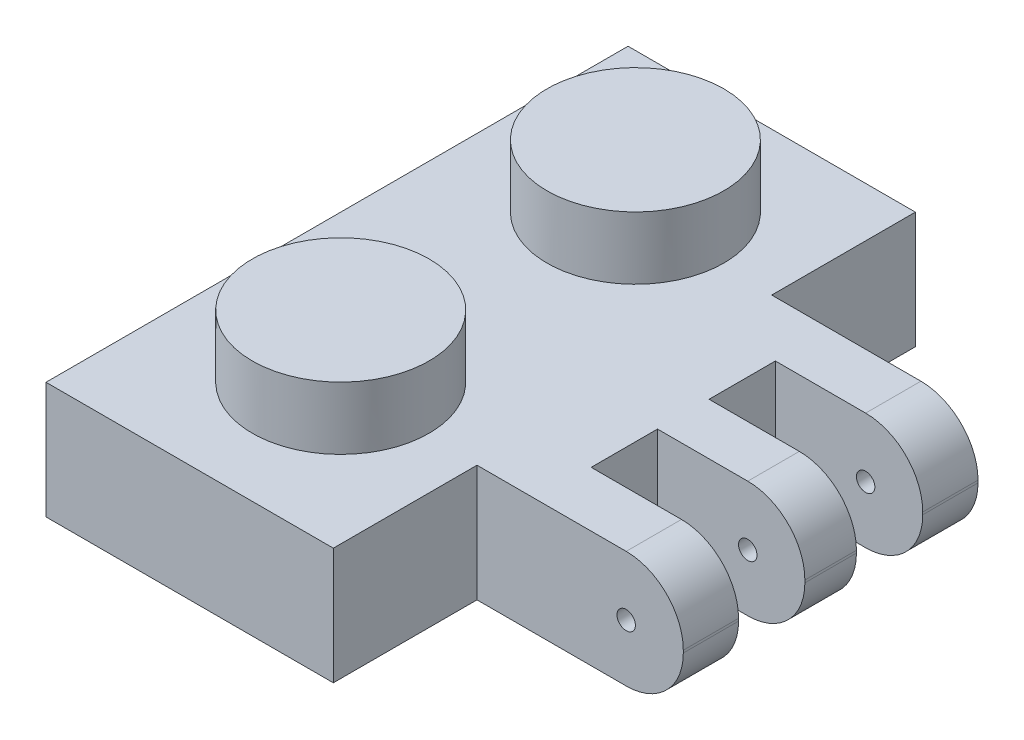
ISO-10303-21;
HEADER;
FILE_DESCRIPTION(('STEP AP214'),'2;1');
FILE_NAME('part.step','',(''),(''),'','','');
FILE_SCHEMA(('AUTOMOTIVE_DESIGN { 1 0 10303 214 1 1 1 1 }'));
ENDSEC;
DATA;
#1=APPLICATION_CONTEXT('core data for automotive mechanical design processes');
#2=APPLICATION_PROTOCOL_DEFINITION('international standard','automotive_design',2000,#1);
#3=PRODUCT_CONTEXT('',#1,'mechanical');
#4=PRODUCT('Part','Part','',(#3));
#5=PRODUCT_RELATED_PRODUCT_CATEGORY('part','',(#4));
#6=PRODUCT_DEFINITION_FORMATION('','',#4);
#7=PRODUCT_DEFINITION_CONTEXT('part definition',#1,'design');
#8=PRODUCT_DEFINITION('design','',#6,#7);
#9=PRODUCT_DEFINITION_SHAPE('','',#8);
#10=(LENGTH_UNIT() NAMED_UNIT(*) SI_UNIT(.MILLI.,.METRE.));
#11=(NAMED_UNIT(*) PLANE_ANGLE_UNIT() SI_UNIT($,.RADIAN.));
#12=(NAMED_UNIT(*) SI_UNIT($,.STERADIAN.) SOLID_ANGLE_UNIT());
#13=UNCERTAINTY_MEASURE_WITH_UNIT(LENGTH_MEASURE(1.E-05),#10,'distance_accuracy_value','');
#14=(GEOMETRIC_REPRESENTATION_CONTEXT(3) GLOBAL_UNCERTAINTY_ASSIGNED_CONTEXT((#13)) GLOBAL_UNIT_ASSIGNED_CONTEXT((#10,
#11,#12)) REPRESENTATION_CONTEXT('',''));
#15=CARTESIAN_POINT('',(0.,0.,0.));
#16=DIRECTION('',(0.,0.,1.));
#17=DIRECTION('',(1.,0.,0.));
#18=AXIS2_PLACEMENT_3D('',#15,#16,#17);
#19=CARTESIAN_POINT('',(13.4,0.,-3.9));
#20=DIRECTION('',(1.,0.,0.));
#21=DIRECTION('',(0.,0.,-1.));
#22=AXIS2_PLACEMENT_3D('',#19,#20,#21);
#23=PLANE('',#22);
#24=DIRECTION('',(0.,-1.,0.));
#25=VECTOR('',#24,1.);
#26=CARTESIAN_POINT('',(13.4,3.166,-3.9));
#27=LINE('',#26,#25);
#28=CARTESIAN_POINT('',(13.4,1.616,-3.9));
#29=VERTEX_POINT('',#28);
#30=CARTESIAN_POINT('',(13.4,1.55,-3.9));
#31=VERTEX_POINT('',#30);
#32=EDGE_CURVE('E302',#29,#31,#27,.T.);
#33=ORIENTED_EDGE('',*,*,#32,.T.);
#34=DIRECTION('',(0.,0.,-1.));
#35=VECTOR('',#34,1.);
#36=CARTESIAN_POINT('',(13.4,1.55,-3.9));
#37=LINE('',#36,#35);
#38=CARTESIAN_POINT('',(13.4,1.55,-5.4));
#39=VERTEX_POINT('',#38);
#40=EDGE_CURVE('E350',#31,#39,#37,.T.);
#41=ORIENTED_EDGE('',*,*,#40,.T.);
#42=DIRECTION('',(0.,1.,0.));
#43=VECTOR('',#42,1.);
#44=CARTESIAN_POINT('',(13.4,-5.00000000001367E-05,-5.4));
#45=LINE('',#44,#43);
#46=CARTESIAN_POINT('',(13.4,1.616,-5.4));
#47=VERTEX_POINT('',#46);
#48=EDGE_CURVE('E267',#39,#47,#45,.T.);
#49=ORIENTED_EDGE('',*,*,#48,.T.);
#50=DIRECTION('',(0.,0.,1.));
#51=VECTOR('',#50,1.);
#52=CARTESIAN_POINT('',(13.4,1.616,-3.9));
#53=LINE('',#52,#51);
#54=EDGE_CURVE('E348',#47,#29,#53,.T.);
#55=ORIENTED_EDGE('',*,*,#54,.T.);
#56=EDGE_LOOP('',(#33,#41,#49,#55));
#57=FACE_BOUND('',#56,.T.);
#58=ADVANCED_FACE('F36',(#57),#23,.T.);
#59=DIRECTION('',(0.,1.,0.));
#60=VECTOR('',#59,1.);
#61=CARTESIAN_POINT('',(13.4,-5.00000000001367E-05,-7.2));
#62=LINE('',#61,#60);
#63=CARTESIAN_POINT('',(13.4,1.55,-7.2));
#64=VERTEX_POINT('',#63);
#65=CARTESIAN_POINT('',(13.4,1.616,-7.2));
#66=VERTEX_POINT('',#65);
#67=EDGE_CURVE('E256',#64,#66,#62,.T.);
#68=ORIENTED_EDGE('',*,*,#67,.F.);
#69=DIRECTION('',(0.,0.,-1.));
#70=VECTOR('',#69,1.);
#71=CARTESIAN_POINT('',(13.4,1.55,-3.9));
#72=LINE('',#71,#70);
#73=CARTESIAN_POINT('',(13.4,1.55,-8.6));
#74=VERTEX_POINT('',#73);
#75=EDGE_CURVE('E338',#64,#74,#72,.T.);
#76=ORIENTED_EDGE('',*,*,#75,.T.);
#77=DIRECTION('',(0.,-1.,0.));
#78=VECTOR('',#77,1.);
#79=CARTESIAN_POINT('',(13.4,3.166,-8.6));
#80=LINE('',#79,#78);
#81=CARTESIAN_POINT('',(13.4,1.616,-8.6));
#82=VERTEX_POINT('',#81);
#83=EDGE_CURVE('E270',#82,#74,#80,.T.);
#84=ORIENTED_EDGE('',*,*,#83,.F.);
#85=DIRECTION('',(0.,0.,1.));
#86=VECTOR('',#85,1.);
#87=CARTESIAN_POINT('',(13.4,1.616,-7.2));
#88=LINE('',#87,#86);
#89=EDGE_CURVE('E335',#82,#66,#88,.T.);
#90=ORIENTED_EDGE('',*,*,#89,.T.);
#91=EDGE_LOOP('',(#68,#76,#84,#90));
#92=FACE_BOUND('',#91,.T.);
#93=ADVANCED_FACE('F577',(#92),#23,.T.);
#94=CARTESIAN_POINT('',(7.8,3.166,0.));
#95=DIRECTION('',(-1.,0.,0.));
#96=DIRECTION('',(0.,0.,1.));
#97=AXIS2_PLACEMENT_3D('',#94,#95,#96);
#98=PLANE('',#97);
#99=DIRECTION('',(0.,-1.,0.));
#100=VECTOR('',#99,1.);
#101=CARTESIAN_POINT('',(7.8,3.166,-3.9));
#102=LINE('',#101,#100);
#103=CARTESIAN_POINT('',(7.8,3.166,-3.9));
#104=VERTEX_POINT('',#103);
#105=CARTESIAN_POINT('',(7.8,0.,-3.9));
#106=VERTEX_POINT('',#105);
#107=EDGE_CURVE('E294',#104,#106,#102,.T.);
#108=ORIENTED_EDGE('',*,*,#107,.F.);
#109=DIRECTION('',(0.,0.,-1.));
#110=VECTOR('',#109,1.);
#111=CARTESIAN_POINT('',(7.8,3.166,0.));
#112=LINE('',#111,#110);
#113=CARTESIAN_POINT('',(7.8,3.166,0.));
#114=VERTEX_POINT('',#113);
#115=EDGE_CURVE('E362',#114,#104,#112,.T.);
#116=ORIENTED_EDGE('',*,*,#115,.F.);
#117=DIRECTION('',(0.,-1.,0.));
#118=VECTOR('',#117,1.);
#119=CARTESIAN_POINT('',(7.8,3.166,0.));
#120=LINE('',#119,#118);
#121=CARTESIAN_POINT('',(7.8,0.,0.));
#122=VERTEX_POINT('',#121);
#123=EDGE_CURVE('E435',#114,#122,#120,.T.);
#124=ORIENTED_EDGE('',*,*,#123,.T.);
#125=DIRECTION('',(0.,0.,-1.));
#126=VECTOR('',#125,1.);
#127=CARTESIAN_POINT('',(7.8,0.,0.));
#128=LINE('',#127,#126);
#129=EDGE_CURVE('E423',#122,#106,#128,.T.);
#130=ORIENTED_EDGE('',*,*,#129,.T.);
#131=EDGE_LOOP('',(#108,#116,#124,#130));
#132=FACE_BOUND('',#131,.T.);
#133=ADVANCED_FACE('F582',(#132),#98,.F.);
#134=DIRECTION('',(0.,1.,0.));
#135=VECTOR('',#134,1.);
#136=CARTESIAN_POINT('',(7.8,3.166,-11.9));
#137=LINE('',#136,#135);
#138=CARTESIAN_POINT('',(7.8,0.,-11.9));
#139=VERTEX_POINT('',#138);
#140=CARTESIAN_POINT('',(7.8,3.166,-11.9));
#141=VERTEX_POINT('',#140);
#142=EDGE_CURVE('E305',#139,#141,#137,.T.);
#143=ORIENTED_EDGE('',*,*,#142,.F.);
#144=CARTESIAN_POINT('',(7.8,0.,-15.8));
#145=VERTEX_POINT('',#144);
#146=EDGE_CURVE('E416',#139,#145,#128,.T.);
#147=ORIENTED_EDGE('',*,*,#146,.T.);
#148=DIRECTION('',(0.,-1.,0.));
#149=VECTOR('',#148,1.);
#150=CARTESIAN_POINT('',(7.8,3.166,-15.8));
#151=LINE('',#150,#149);
#152=CARTESIAN_POINT('',(7.8,3.166,-15.8));
#153=VERTEX_POINT('',#152);
#154=EDGE_CURVE('E438',#153,#145,#151,.T.);
#155=ORIENTED_EDGE('',*,*,#154,.F.);
#156=EDGE_CURVE('E397',#141,#153,#112,.T.);
#157=ORIENTED_EDGE('',*,*,#156,.F.);
#158=EDGE_LOOP('',(#143,#147,#155,#157));
#159=FACE_BOUND('',#158,.T.);
#160=ADVANCED_FACE('F563',(#159),#98,.F.);
#161=CARTESIAN_POINT('',(0.,3.166,-15.8));
#162=DIRECTION('',(0.,-1.,0.));
#163=DIRECTION('',(0.,0.,-1.));
#164=AXIS2_PLACEMENT_3D('',#161,#162,#163);
#165=PLANE('',#164);
#166=DIRECTION('',(1.,0.,0.));
#167=VECTOR('',#166,1.);
#168=CARTESIAN_POINT('',(9.4,3.166,-10.4));
#169=LINE('',#168,#167);
#170=CARTESIAN_POINT('',(9.4,3.166,-10.4));
#171=VERTEX_POINT('',#170);
#172=CARTESIAN_POINT('',(11.85,3.166,-10.4));
#173=VERTEX_POINT('',#172);
#174=EDGE_CURVE('E295',#171,#173,#169,.T.);
#175=ORIENTED_EDGE('',*,*,#174,.T.);
#176=DIRECTION('',(0.,0.,1.));
#177=VECTOR('',#176,1.);
#178=CARTESIAN_POINT('',(11.85,3.166,-11.9));
#179=LINE('',#178,#177);
#180=CARTESIAN_POINT('',(11.85,3.166,-11.9));
#181=VERTEX_POINT('',#180);
#182=EDGE_CURVE('E333',#173,#181,#179,.F.);
#183=ORIENTED_EDGE('',*,*,#182,.T.);
#184=DIRECTION('',(-1.,0.,0.));
#185=VECTOR('',#184,1.);
#186=CARTESIAN_POINT('',(13.4,3.166,-11.9));
#187=LINE('',#186,#185);
#188=EDGE_CURVE('E326',#181,#141,#187,.T.);
#189=ORIENTED_EDGE('',*,*,#188,.T.);
#190=ORIENTED_EDGE('',*,*,#156,.T.);
#191=DIRECTION('',(-1.,0.,0.));
#192=VECTOR('',#191,1.);
#193=CARTESIAN_POINT('',(0.,3.166,-15.8));
#194=LINE('',#193,#192);
#195=CARTESIAN_POINT('',(0.,3.166,-15.8));
#196=VERTEX_POINT('',#195);
#197=EDGE_CURVE('E406',#153,#196,#194,.T.);
#198=ORIENTED_EDGE('',*,*,#197,.T.);
#199=DIRECTION('',(0.,0.,1.));
#200=VECTOR('',#199,1.);
#201=CARTESIAN_POINT('',(0.,3.166,0.));
#202=LINE('',#201,#200);
#203=CARTESIAN_POINT('',(0.,3.166,0.));
#204=VERTEX_POINT('',#203);
#205=EDGE_CURVE('E448',#196,#204,#202,.T.);
#206=ORIENTED_EDGE('',*,*,#205,.T.);
#207=DIRECTION('',(1.,0.,0.));
#208=VECTOR('',#207,1.);
#209=CARTESIAN_POINT('',(0.,3.166,0.));
#210=LINE('',#209,#208);
#211=EDGE_CURVE('E400',#204,#114,#210,.T.);
#212=ORIENTED_EDGE('',*,*,#211,.T.);
#213=ORIENTED_EDGE('',*,*,#115,.T.);
#214=DIRECTION('',(-1.,0.,0.));
#215=VECTOR('',#214,1.);
#216=CARTESIAN_POINT('',(13.4,3.166,-3.9));
#217=LINE('',#216,#215);
#218=CARTESIAN_POINT('',(11.85,3.166,-3.9));
#219=VERTEX_POINT('',#218);
#220=EDGE_CURVE('E308',#219,#104,#217,.T.);
#221=ORIENTED_EDGE('',*,*,#220,.F.);
#222=DIRECTION('',(0.,0.,1.));
#223=VECTOR('',#222,1.);
#224=CARTESIAN_POINT('',(11.85,3.166,-5.4));
#225=LINE('',#224,#223);
#226=CARTESIAN_POINT('',(11.85,3.166,-5.4));
#227=VERTEX_POINT('',#226);
#228=EDGE_CURVE('E329',#219,#227,#225,.F.);
#229=ORIENTED_EDGE('',*,*,#228,.T.);
#230=DIRECTION('',(1.,0.,0.));
#231=VECTOR('',#230,1.);
#232=CARTESIAN_POINT('',(13.4,3.166,-5.4));
#233=LINE('',#232,#231);
#234=CARTESIAN_POINT('',(9.4,3.166,-5.4));
#235=VERTEX_POINT('',#234);
#236=EDGE_CURVE('E262',#235,#227,#233,.T.);
#237=ORIENTED_EDGE('',*,*,#236,.F.);
#238=DIRECTION('',(0.,0.,1.));
#239=VECTOR('',#238,1.);
#240=CARTESIAN_POINT('',(9.4,3.166,-7.2));
#241=LINE('',#240,#239);
#242=CARTESIAN_POINT('',(9.4,3.166,-7.2));
#243=VERTEX_POINT('',#242);
#244=EDGE_CURVE('E244',#243,#235,#241,.T.);
#245=ORIENTED_EDGE('',*,*,#244,.F.);
#246=DIRECTION('',(-1.,0.,0.));
#247=VECTOR('',#246,1.);
#248=CARTESIAN_POINT('',(13.4,3.166,-7.2));
#249=LINE('',#248,#247);
#250=CARTESIAN_POINT('',(11.85,3.166,-7.2));
#251=VERTEX_POINT('',#250);
#252=EDGE_CURVE('E233',#251,#243,#249,.T.);
#253=ORIENTED_EDGE('',*,*,#252,.F.);
#254=DIRECTION('',(0.,0.,1.));
#255=VECTOR('',#254,1.);
#256=CARTESIAN_POINT('',(11.85,3.166,-8.6));
#257=LINE('',#256,#255);
#258=CARTESIAN_POINT('',(11.85,3.166,-8.6));
#259=VERTEX_POINT('',#258);
#260=EDGE_CURVE('E331',#251,#259,#257,.F.);
#261=ORIENTED_EDGE('',*,*,#260,.T.);
#262=DIRECTION('',(1.,0.,0.));
#263=VECTOR('',#262,1.);
#264=CARTESIAN_POINT('',(9.4,3.166,-8.6));
#265=LINE('',#264,#263);
#266=CARTESIAN_POINT('',(9.4,3.166,-8.6));
#267=VERTEX_POINT('',#266);
#268=EDGE_CURVE('E291',#267,#259,#265,.T.);
#269=ORIENTED_EDGE('',*,*,#268,.F.);
#270=DIRECTION('',(0.,0.,1.));
#271=VECTOR('',#270,1.);
#272=CARTESIAN_POINT('',(9.4,3.166,-8.6));
#273=LINE('',#272,#271);
#274=EDGE_CURVE('E283',#171,#267,#273,.T.);
#275=ORIENTED_EDGE('',*,*,#274,.F.);
#276=EDGE_LOOP('',(#175,#183,#189,#190,#198,#206,#212,#213,#221,#229,#237,#245,#253,#261,#269,#275));
#277=FACE_BOUND('',#276,.T.);
#278=CARTESIAN_POINT('',(4.,3.166,-4.));
#279=DIRECTION('',(0.,-1.,0.));
#280=DIRECTION('',(0.,0.,-1.));
#281=AXIS2_PLACEMENT_3D('',#278,#279,#280);
#282=CIRCLE('',#281,2.4);
#283=CARTESIAN_POINT('',(4.,3.166,-6.4));
#284=VERTEX_POINT('',#283);
#285=EDGE_CURVE('E429',#284,#284,#282,.F.);
#286=ORIENTED_EDGE('',*,*,#285,.F.);
#287=EDGE_LOOP('',(#286));
#288=FACE_BOUND('',#287,.T.);
#289=CARTESIAN_POINT('',(4.,3.166,-12.));
#290=DIRECTION('',(0.,-1.,0.));
#291=DIRECTION('',(0.,0.,-1.));
#292=AXIS2_PLACEMENT_3D('',#289,#290,#291);
#293=CIRCLE('',#292,2.4);
#294=CARTESIAN_POINT('',(4.,3.166,-14.4));
#295=VERTEX_POINT('',#294);
#296=EDGE_CURVE('E426',#295,#295,#293,.F.);
#297=ORIENTED_EDGE('',*,*,#296,.F.);
#298=EDGE_LOOP('',(#297));
#299=FACE_BOUND('',#298,.T.);
#300=ADVANCED_FACE('F259',(#277,#288,#299),#165,.F.);
#301=CARTESIAN_POINT('',(0.,3.166,0.));
#302=DIRECTION('',(1.,0.,0.));
#303=DIRECTION('',(0.,0.,-1.));
#304=AXIS2_PLACEMENT_3D('',#301,#302,#303);
#305=PLANE('',#304);
#306=DIRECTION('',(0.,0.,1.));
#307=VECTOR('',#306,1.);
#308=CARTESIAN_POINT('',(0.,0.,0.));
#309=LINE('',#308,#307);
#310=CARTESIAN_POINT('',(0.,0.,-15.8));
#311=VERTEX_POINT('',#310);
#312=CARTESIAN_POINT('',(0.,0.,0.));
#313=VERTEX_POINT('',#312);
#314=EDGE_CURVE('E410',#311,#313,#309,.T.);
#315=ORIENTED_EDGE('',*,*,#314,.T.);
#316=DIRECTION('',(0.,-1.,0.));
#317=VECTOR('',#316,1.);
#318=CARTESIAN_POINT('',(0.,3.166,0.));
#319=LINE('',#318,#317);
#320=EDGE_CURVE('E432',#204,#313,#319,.T.);
#321=ORIENTED_EDGE('',*,*,#320,.F.);
#322=ORIENTED_EDGE('',*,*,#205,.F.);
#323=DIRECTION('',(0.,-1.,0.));
#324=VECTOR('',#323,1.);
#325=CARTESIAN_POINT('',(0.,3.166,-15.8));
#326=LINE('',#325,#324);
#327=EDGE_CURVE('E409',#196,#311,#326,.T.);
#328=ORIENTED_EDGE('',*,*,#327,.T.);
#329=EDGE_LOOP('',(#315,#321,#322,#328));
#330=FACE_BOUND('',#329,.T.);
#331=ADVANCED_FACE('F445',(#330),#305,.F.);
#332=CARTESIAN_POINT('',(0.,3.166,0.));
#333=DIRECTION('',(0.,0.,-1.));
#334=DIRECTION('',(-1.,0.,0.));
#335=AXIS2_PLACEMENT_3D('',#332,#333,#334);
#336=PLANE('',#335);
#337=DIRECTION('',(1.,0.,0.));
#338=VECTOR('',#337,1.);
#339=CARTESIAN_POINT('',(0.,0.,0.));
#340=LINE('',#339,#338);
#341=EDGE_CURVE('E413',#313,#122,#340,.T.);
#342=ORIENTED_EDGE('',*,*,#341,.T.);
#343=ORIENTED_EDGE('',*,*,#123,.F.);
#344=ORIENTED_EDGE('',*,*,#211,.F.);
#345=ORIENTED_EDGE('',*,*,#320,.T.);
#346=EDGE_LOOP('',(#342,#343,#344,#345));
#347=FACE_BOUND('',#346,.T.);
#348=ADVANCED_FACE('F456',(#347),#336,.F.);
#349=CARTESIAN_POINT('',(0.,3.166,-15.8));
#350=DIRECTION('',(0.,0.,1.));
#351=DIRECTION('',(1.,0.,0.));
#352=AXIS2_PLACEMENT_3D('',#349,#350,#351);
#353=PLANE('',#352);
#354=DIRECTION('',(-1.,0.,0.));
#355=VECTOR('',#354,1.);
#356=CARTESIAN_POINT('',(0.,0.,-15.8));
#357=LINE('',#356,#355);
#358=EDGE_CURVE('E419',#145,#311,#357,.T.);
#359=ORIENTED_EDGE('',*,*,#358,.T.);
#360=ORIENTED_EDGE('',*,*,#327,.F.);
#361=ORIENTED_EDGE('',*,*,#197,.F.);
#362=ORIENTED_EDGE('',*,*,#154,.T.);
#363=EDGE_LOOP('',(#359,#360,#361,#362));
#364=FACE_BOUND('',#363,.T.);
#365=ADVANCED_FACE('F565',(#364),#353,.F.);
#366=CARTESIAN_POINT('',(0.,0.,-15.8));
#367=DIRECTION('',(0.,-1.,0.));
#368=DIRECTION('',(0.,0.,-1.));
#369=AXIS2_PLACEMENT_3D('',#366,#367,#368);
#370=PLANE('',#369);
#371=DIRECTION('',(-1.,0.,0.));
#372=VECTOR('',#371,1.);
#373=CARTESIAN_POINT('',(13.4,0.,-11.9));
#374=LINE('',#373,#372);
#375=CARTESIAN_POINT('',(11.85,0.,-11.9));
#376=VERTEX_POINT('',#375);
#377=EDGE_CURVE('E390',#376,#139,#374,.T.);
#378=ORIENTED_EDGE('',*,*,#377,.F.);
#379=DIRECTION('',(0.,0.,-1.));
#380=VECTOR('',#379,1.);
#381=CARTESIAN_POINT('',(11.85,0.,-15.8));
#382=LINE('',#381,#380);
#383=CARTESIAN_POINT('',(11.85,0.,-10.4));
#384=VERTEX_POINT('',#383);
#385=EDGE_CURVE('E533',#376,#384,#382,.F.);
#386=ORIENTED_EDGE('',*,*,#385,.T.);
#387=DIRECTION('',(1.,0.,0.));
#388=VECTOR('',#387,1.);
#389=CARTESIAN_POINT('',(9.4,0.,-10.4));
#390=LINE('',#389,#388);
#391=CARTESIAN_POINT('',(9.4,0.,-10.4));
#392=VERTEX_POINT('',#391);
#393=EDGE_CURVE('E297',#392,#384,#390,.T.);
#394=ORIENTED_EDGE('',*,*,#393,.F.);
#395=DIRECTION('',(0.,0.,-1.));
#396=VECTOR('',#395,1.);
#397=CARTESIAN_POINT('',(9.4,0.,-8.6));
#398=LINE('',#397,#396);
#399=CARTESIAN_POINT('',(9.4,0.,-8.6));
#400=VERTEX_POINT('',#399);
#401=EDGE_CURVE('E276',#400,#392,#398,.T.);
#402=ORIENTED_EDGE('',*,*,#401,.F.);
#403=DIRECTION('',(1.,0.,0.));
#404=VECTOR('',#403,1.);
#405=CARTESIAN_POINT('',(9.4,0.,-8.6));
#406=LINE('',#405,#404);
#407=CARTESIAN_POINT('',(11.85,0.,-8.6));
#408=VERTEX_POINT('',#407);
#409=EDGE_CURVE('E286',#400,#408,#406,.T.);
#410=ORIENTED_EDGE('',*,*,#409,.T.);
#411=DIRECTION('',(0.,0.,-1.));
#412=VECTOR('',#411,1.);
#413=CARTESIAN_POINT('',(11.85,0.,-15.8));
#414=LINE('',#413,#412);
#415=CARTESIAN_POINT('',(11.85,0.,-7.2));
#416=VERTEX_POINT('',#415);
#417=EDGE_CURVE('E531',#408,#416,#414,.F.);
#418=ORIENTED_EDGE('',*,*,#417,.T.);
#419=DIRECTION('',(1.,0.,0.));
#420=VECTOR('',#419,1.);
#421=CARTESIAN_POINT('',(0.,0.,-7.2));
#422=LINE('',#421,#420);
#423=CARTESIAN_POINT('',(9.4,0.,-7.2));
#424=VERTEX_POINT('',#423);
#425=EDGE_CURVE('E321',#424,#416,#422,.T.);
#426=ORIENTED_EDGE('',*,*,#425,.F.);
#427=DIRECTION('',(0.,0.,-1.));
#428=VECTOR('',#427,1.);
#429=CARTESIAN_POINT('',(9.4,0.,-15.8));
#430=LINE('',#429,#428);
#431=CARTESIAN_POINT('',(9.4,0.,-5.4));
#432=VERTEX_POINT('',#431);
#433=EDGE_CURVE('E253',#432,#424,#430,.T.);
#434=ORIENTED_EDGE('',*,*,#433,.F.);
#435=DIRECTION('',(-1.,0.,0.));
#436=VECTOR('',#435,1.);
#437=CARTESIAN_POINT('',(0.,0.,-5.4));
#438=LINE('',#437,#436);
#439=CARTESIAN_POINT('',(11.85,0.,-5.4));
#440=VERTEX_POINT('',#439);
#441=EDGE_CURVE('E374',#440,#432,#438,.T.);
#442=ORIENTED_EDGE('',*,*,#441,.F.);
#443=DIRECTION('',(0.,0.,-1.));
#444=VECTOR('',#443,1.);
#445=CARTESIAN_POINT('',(11.85,0.,-15.8));
#446=LINE('',#445,#444);
#447=CARTESIAN_POINT('',(11.85,0.,-3.9));
#448=VERTEX_POINT('',#447);
#449=EDGE_CURVE('E372',#440,#448,#446,.F.);
#450=ORIENTED_EDGE('',*,*,#449,.T.);
#451=DIRECTION('',(-1.,0.,0.));
#452=VECTOR('',#451,1.);
#453=CARTESIAN_POINT('',(13.4,0.,-3.9));
#454=LINE('',#453,#452);
#455=EDGE_CURVE('E522',#448,#106,#454,.T.);
#456=ORIENTED_EDGE('',*,*,#455,.T.);
#457=ORIENTED_EDGE('',*,*,#129,.F.);
#458=ORIENTED_EDGE('',*,*,#341,.F.);
#459=ORIENTED_EDGE('',*,*,#314,.F.);
#460=ORIENTED_EDGE('',*,*,#358,.F.);
#461=ORIENTED_EDGE('',*,*,#146,.F.);
#462=EDGE_LOOP('',(#378,#386,#394,#402,#410,#418,#426,#434,#442,#450,#456,#457,#458,#459,#460,#461));
#463=FACE_BOUND('',#462,.T.);
#464=DIRECTION('',(0.,0.,-1.));
#465=VECTOR('',#464,1.);
#466=CARTESIAN_POINT('',(1.45,0.,-1.45));
#467=LINE('',#466,#465);
#468=CARTESIAN_POINT('',(1.45,0.,-1.45));
#469=VERTEX_POINT('',#468);
#470=CARTESIAN_POINT('',(1.45,0.,-6.35));
#471=VERTEX_POINT('',#470);
#472=EDGE_CURVE('E495',#469,#471,#467,.T.);
#473=ORIENTED_EDGE('',*,*,#472,.F.);
#474=DIRECTION('',(-1.,0.,0.));
#475=VECTOR('',#474,1.);
#476=CARTESIAN_POINT('',(1.45,0.,-1.45));
#477=LINE('',#476,#475);
#478=CARTESIAN_POINT('',(6.35,0.,-1.45));
#479=VERTEX_POINT('',#478);
#480=EDGE_CURVE('E500',#479,#469,#477,.T.);
#481=ORIENTED_EDGE('',*,*,#480,.F.);
#482=DIRECTION('',(0.,0.,1.));
#483=VECTOR('',#482,1.);
#484=CARTESIAN_POINT('',(6.35,0.,-1.45));
#485=LINE('',#484,#483);
#486=CARTESIAN_POINT('',(6.35,0.,-6.35));
#487=VERTEX_POINT('',#486);
#488=EDGE_CURVE('E505',#487,#479,#485,.T.);
#489=ORIENTED_EDGE('',*,*,#488,.F.);
#490=DIRECTION('',(1.,0.,0.));
#491=VECTOR('',#490,1.);
#492=CARTESIAN_POINT('',(1.45,0.,-6.35));
#493=LINE('',#492,#491);
#494=EDGE_CURVE('E521',#471,#487,#493,.T.);
#495=ORIENTED_EDGE('',*,*,#494,.F.);
#496=EDGE_LOOP('',(#473,#481,#489,#495));
#497=FACE_BOUND('',#496,.T.);
#498=DIRECTION('',(0.,0.,-1.));
#499=VECTOR('',#498,1.);
#500=CARTESIAN_POINT('',(1.45,0.,-9.45));
#501=LINE('',#500,#499);
#502=CARTESIAN_POINT('',(1.45,0.,-9.45));
#503=VERTEX_POINT('',#502);
#504=CARTESIAN_POINT('',(1.45,0.,-14.35));
#505=VERTEX_POINT('',#504);
#506=EDGE_CURVE('E480',#503,#505,#501,.T.);
#507=ORIENTED_EDGE('',*,*,#506,.F.);
#508=DIRECTION('',(-1.,0.,0.));
#509=VECTOR('',#508,1.);
#510=CARTESIAN_POINT('',(1.45,0.,-9.45));
#511=LINE('',#510,#509);
#512=CARTESIAN_POINT('',(6.35,0.,-9.45));
#513=VERTEX_POINT('',#512);
#514=EDGE_CURVE('E470',#513,#503,#511,.T.);
#515=ORIENTED_EDGE('',*,*,#514,.F.);
#516=DIRECTION('',(0.,0.,1.));
#517=VECTOR('',#516,1.);
#518=CARTESIAN_POINT('',(6.35,0.,-9.45));
#519=LINE('',#518,#517);
#520=CARTESIAN_POINT('',(6.35,0.,-14.35));
#521=VERTEX_POINT('',#520);
#522=EDGE_CURVE('E474',#521,#513,#519,.T.);
#523=ORIENTED_EDGE('',*,*,#522,.F.);
#524=DIRECTION('',(1.,0.,0.));
#525=VECTOR('',#524,1.);
#526=CARTESIAN_POINT('',(1.45,0.,-14.35));
#527=LINE('',#526,#525);
#528=EDGE_CURVE('E477',#505,#521,#527,.T.);
#529=ORIENTED_EDGE('',*,*,#528,.F.);
#530=EDGE_LOOP('',(#507,#515,#523,#529));
#531=FACE_BOUND('',#530,.T.);
#532=ADVANCED_FACE('F377',(#463,#497,#531),#370,.T.);
#533=CARTESIAN_POINT('',(4.,4.866,-4.));
#534=DIRECTION('',(0.,-1.,0.));
#535=DIRECTION('',(0.,0.,-1.));
#536=AXIS2_PLACEMENT_3D('',#533,#534,#535);
#537=CYLINDRICAL_SURFACE('',#536,2.4);
#538=CARTESIAN_POINT('',(4.,4.866,-4.));
#539=DIRECTION('',(0.,1.,0.));
#540=DIRECTION('',(0.,0.,1.));
#541=AXIS2_PLACEMENT_3D('',#538,#539,#540);
#542=CIRCLE('',#541,2.4);
#543=CARTESIAN_POINT('',(4.,4.866,-1.6));
#544=VERTEX_POINT('',#543);
#545=EDGE_CURVE('E414',#544,#544,#542,.T.);
#546=ORIENTED_EDGE('',*,*,#545,.F.);
#547=EDGE_LOOP('',(#546));
#548=FACE_BOUND('',#547,.T.);
#549=ORIENTED_EDGE('',*,*,#285,.T.);
#550=EDGE_LOOP('',(#549));
#551=FACE_BOUND('',#550,.T.);
#552=ADVANCED_FACE('F572',(#548,#551),#537,.T.);
#553=CARTESIAN_POINT('',(4.,4.866,-4.));
#554=DIRECTION('',(0.,1.,0.));
#555=DIRECTION('',(0.,0.,1.));
#556=AXIS2_PLACEMENT_3D('',#553,#554,#555);
#557=PLANE('',#556);
#558=ORIENTED_EDGE('',*,*,#545,.T.);
#559=EDGE_LOOP('',(#558));
#560=FACE_BOUND('',#559,.T.);
#561=ADVANCED_FACE('F647',(#560),#557,.T.);
#562=CARTESIAN_POINT('',(1.45,2.5,-9.45));
#563=DIRECTION('',(-1.,0.,0.));
#564=DIRECTION('',(0.,0.,1.));
#565=AXIS2_PLACEMENT_3D('',#562,#563,#564);
#566=PLANE('',#565);
#567=ORIENTED_EDGE('',*,*,#506,.T.);
#568=DIRECTION('',(0.,-1.,0.));
#569=VECTOR('',#568,1.);
#570=CARTESIAN_POINT('',(1.45,2.5,-14.35));
#571=LINE('',#570,#569);
#572=CARTESIAN_POINT('',(1.45,2.5,-14.35));
#573=VERTEX_POINT('',#572);
#574=EDGE_CURVE('E461',#573,#505,#571,.T.);
#575=ORIENTED_EDGE('',*,*,#574,.F.);
#576=DIRECTION('',(0.,0.,-1.));
#577=VECTOR('',#576,1.);
#578=CARTESIAN_POINT('',(1.45,2.5,-9.45));
#579=LINE('',#578,#577);
#580=CARTESIAN_POINT('',(1.45,2.5,-9.45));
#581=VERTEX_POINT('',#580);
#582=EDGE_CURVE('E473',#581,#573,#579,.T.);
#583=ORIENTED_EDGE('',*,*,#582,.F.);
#584=DIRECTION('',(0.,-1.,0.));
#585=VECTOR('',#584,1.);
#586=CARTESIAN_POINT('',(1.45,2.5,-9.45));
#587=LINE('',#586,#585);
#588=EDGE_CURVE('E460',#581,#503,#587,.T.);
#589=ORIENTED_EDGE('',*,*,#588,.T.);
#590=EDGE_LOOP('',(#567,#575,#583,#589));
#591=FACE_BOUND('',#590,.T.);
#592=ADVANCED_FACE('F637',(#591),#566,.F.);
#593=CARTESIAN_POINT('',(1.45,2.5,-9.45));
#594=DIRECTION('',(0.,0.,1.));
#595=DIRECTION('',(1.,0.,0.));
#596=AXIS2_PLACEMENT_3D('',#593,#594,#595);
#597=PLANE('',#596);
#598=ORIENTED_EDGE('',*,*,#514,.T.);
#599=ORIENTED_EDGE('',*,*,#588,.F.);
#600=DIRECTION('',(-1.,0.,0.));
#601=VECTOR('',#600,1.);
#602=CARTESIAN_POINT('',(1.45,2.5,-9.45));
#603=LINE('',#602,#601);
#604=CARTESIAN_POINT('',(6.35,2.5,-9.45));
#605=VERTEX_POINT('',#604);
#606=EDGE_CURVE('E465',#605,#581,#603,.T.);
#607=ORIENTED_EDGE('',*,*,#606,.F.);
#608=DIRECTION('',(0.,-1.,0.));
#609=VECTOR('',#608,1.);
#610=CARTESIAN_POINT('',(6.35,2.5,-9.45));
#611=LINE('',#610,#609);
#612=EDGE_CURVE('E467',#605,#513,#611,.T.);
#613=ORIENTED_EDGE('',*,*,#612,.T.);
#614=EDGE_LOOP('',(#598,#599,#607,#613));
#615=FACE_BOUND('',#614,.T.);
#616=ADVANCED_FACE('F633',(#615),#597,.F.);
#617=CARTESIAN_POINT('',(6.35,2.5,-9.45));
#618=DIRECTION('',(1.,0.,0.));
#619=DIRECTION('',(0.,0.,-1.));
#620=AXIS2_PLACEMENT_3D('',#617,#618,#619);
#621=PLANE('',#620);
#622=ORIENTED_EDGE('',*,*,#522,.T.);
#623=ORIENTED_EDGE('',*,*,#612,.F.);
#624=DIRECTION('',(0.,0.,1.));
#625=VECTOR('',#624,1.);
#626=CARTESIAN_POINT('',(6.35,2.5,-9.45));
#627=LINE('',#626,#625);
#628=CARTESIAN_POINT('',(6.35,2.5,-14.35));
#629=VERTEX_POINT('',#628);
#630=EDGE_CURVE('E485',#629,#605,#627,.T.);
#631=ORIENTED_EDGE('',*,*,#630,.F.);
#632=DIRECTION('',(0.,-1.,0.));
#633=VECTOR('',#632,1.);
#634=CARTESIAN_POINT('',(6.35,2.5,-14.35));
#635=LINE('',#634,#633);
#636=EDGE_CURVE('E464',#629,#521,#635,.T.);
#637=ORIENTED_EDGE('',*,*,#636,.T.);
#638=EDGE_LOOP('',(#622,#623,#631,#637));
#639=FACE_BOUND('',#638,.T.);
#640=ADVANCED_FACE('F636',(#639),#621,.F.);
#641=CARTESIAN_POINT('',(1.45,2.5,-14.35));
#642=DIRECTION('',(0.,0.,-1.));
#643=DIRECTION('',(-1.,0.,0.));
#644=AXIS2_PLACEMENT_3D('',#641,#642,#643);
#645=PLANE('',#644);
#646=ORIENTED_EDGE('',*,*,#528,.T.);
#647=ORIENTED_EDGE('',*,*,#636,.F.);
#648=DIRECTION('',(1.,0.,0.));
#649=VECTOR('',#648,1.);
#650=CARTESIAN_POINT('',(1.45,2.5,-14.35));
#651=LINE('',#650,#649);
#652=EDGE_CURVE('E488',#573,#629,#651,.T.);
#653=ORIENTED_EDGE('',*,*,#652,.F.);
#654=ORIENTED_EDGE('',*,*,#574,.T.);
#655=EDGE_LOOP('',(#646,#647,#653,#654));
#656=FACE_BOUND('',#655,.T.);
#657=ADVANCED_FACE('F631',(#656),#645,.F.);
#658=CARTESIAN_POINT('',(1.45,2.5,-14.35));
#659=DIRECTION('',(0.,-1.,0.));
#660=DIRECTION('',(0.,0.,-1.));
#661=AXIS2_PLACEMENT_3D('',#658,#659,#660);
#662=PLANE('',#661);
#663=ORIENTED_EDGE('',*,*,#582,.T.);
#664=ORIENTED_EDGE('',*,*,#652,.T.);
#665=ORIENTED_EDGE('',*,*,#630,.T.);
#666=ORIENTED_EDGE('',*,*,#606,.T.);
#667=EDGE_LOOP('',(#663,#664,#665,#666));
#668=FACE_BOUND('',#667,.T.);
#669=ADVANCED_FACE('F625',(#668),#662,.T.);
#670=CARTESIAN_POINT('',(4.,4.866,-12.));
#671=DIRECTION('',(0.,-1.,0.));
#672=DIRECTION('',(0.,0.,-1.));
#673=AXIS2_PLACEMENT_3D('',#670,#671,#672);
#674=CYLINDRICAL_SURFACE('',#673,2.4);
#675=CARTESIAN_POINT('',(4.,4.866,-12.));
#676=DIRECTION('',(0.,1.,0.));
#677=DIRECTION('',(0.,0.,1.));
#678=AXIS2_PLACEMENT_3D('',#675,#676,#677);
#679=CIRCLE('',#678,2.4);
#680=CARTESIAN_POINT('',(4.,4.866,-9.6));
#681=VERTEX_POINT('',#680);
#682=EDGE_CURVE('E482',#681,#681,#679,.T.);
#683=ORIENTED_EDGE('',*,*,#682,.F.);
#684=EDGE_LOOP('',(#683));
#685=FACE_BOUND('',#684,.T.);
#686=ORIENTED_EDGE('',*,*,#296,.T.);
#687=EDGE_LOOP('',(#686));
#688=FACE_BOUND('',#687,.T.);
#689=ADVANCED_FACE('F607',(#685,#688),#674,.T.);
#690=CARTESIAN_POINT('',(4.,4.866,-12.));
#691=DIRECTION('',(0.,1.,0.));
#692=DIRECTION('',(0.,0.,1.));
#693=AXIS2_PLACEMENT_3D('',#690,#691,#692);
#694=PLANE('',#693);
#695=ORIENTED_EDGE('',*,*,#682,.T.);
#696=EDGE_LOOP('',(#695));
#697=FACE_BOUND('',#696,.T.);
#698=ADVANCED_FACE('F620',(#697),#694,.T.);
#699=CARTESIAN_POINT('',(1.45,2.5,-1.45));
#700=DIRECTION('',(-1.,0.,0.));
#701=DIRECTION('',(0.,0.,1.));
#702=AXIS2_PLACEMENT_3D('',#699,#700,#701);
#703=PLANE('',#702);
#704=ORIENTED_EDGE('',*,*,#472,.T.);
#705=DIRECTION('',(0.,-1.,0.));
#706=VECTOR('',#705,1.);
#707=CARTESIAN_POINT('',(1.45,2.5,-6.35));
#708=LINE('',#707,#706);
#709=CARTESIAN_POINT('',(1.45,2.5,-6.35));
#710=VERTEX_POINT('',#709);
#711=EDGE_CURVE('E507',#710,#471,#708,.T.);
#712=ORIENTED_EDGE('',*,*,#711,.F.);
#713=DIRECTION('',(0.,0.,-1.));
#714=VECTOR('',#713,1.);
#715=CARTESIAN_POINT('',(1.45,2.5,-1.45));
#716=LINE('',#715,#714);
#717=CARTESIAN_POINT('',(1.45,2.5,-1.45));
#718=VERTEX_POINT('',#717);
#719=EDGE_CURVE('E520',#718,#710,#716,.T.);
#720=ORIENTED_EDGE('',*,*,#719,.F.);
#721=DIRECTION('',(0.,-1.,0.));
#722=VECTOR('',#721,1.);
#723=CARTESIAN_POINT('',(1.45,2.5,-1.45));
#724=LINE('',#723,#722);
#725=EDGE_CURVE('E497',#718,#469,#724,.T.);
#726=ORIENTED_EDGE('',*,*,#725,.T.);
#727=EDGE_LOOP('',(#704,#712,#720,#726));
#728=FACE_BOUND('',#727,.T.);
#729=ADVANCED_FACE('F600',(#728),#703,.F.);
#730=CARTESIAN_POINT('',(1.45,2.5,-1.45));
#731=DIRECTION('',(0.,0.,1.));
#732=DIRECTION('',(1.,0.,0.));
#733=AXIS2_PLACEMENT_3D('',#730,#731,#732);
#734=PLANE('',#733);
#735=ORIENTED_EDGE('',*,*,#480,.T.);
#736=ORIENTED_EDGE('',*,*,#725,.F.);
#737=DIRECTION('',(-1.,0.,0.));
#738=VECTOR('',#737,1.);
#739=CARTESIAN_POINT('',(1.45,2.5,-1.45));
#740=LINE('',#739,#738);
#741=CARTESIAN_POINT('',(6.35,2.5,-1.45));
#742=VERTEX_POINT('',#741);
#743=EDGE_CURVE('E513',#742,#718,#740,.T.);
#744=ORIENTED_EDGE('',*,*,#743,.F.);
#745=DIRECTION('',(0.,-1.,0.));
#746=VECTOR('',#745,1.);
#747=CARTESIAN_POINT('',(6.35,2.5,-1.45));
#748=LINE('',#747,#746);
#749=EDGE_CURVE('E502',#742,#479,#748,.T.);
#750=ORIENTED_EDGE('',*,*,#749,.T.);
#751=EDGE_LOOP('',(#735,#736,#744,#750));
#752=FACE_BOUND('',#751,.T.);
#753=ADVANCED_FACE('F613',(#752),#734,.F.);
#754=CARTESIAN_POINT('',(6.35,2.5,-1.45));
#755=DIRECTION('',(1.,0.,0.));
#756=DIRECTION('',(0.,0.,-1.));
#757=AXIS2_PLACEMENT_3D('',#754,#755,#756);
#758=PLANE('',#757);
#759=ORIENTED_EDGE('',*,*,#488,.T.);
#760=ORIENTED_EDGE('',*,*,#749,.F.);
#761=DIRECTION('',(0.,0.,1.));
#762=VECTOR('',#761,1.);
#763=CARTESIAN_POINT('',(6.35,2.5,-1.45));
#764=LINE('',#763,#762);
#765=CARTESIAN_POINT('',(6.35,2.5,-6.35));
#766=VERTEX_POINT('',#765);
#767=EDGE_CURVE('E516',#766,#742,#764,.T.);
#768=ORIENTED_EDGE('',*,*,#767,.F.);
#769=DIRECTION('',(0.,-1.,0.));
#770=VECTOR('',#769,1.);
#771=CARTESIAN_POINT('',(6.35,2.5,-6.35));
#772=LINE('',#771,#770);
#773=EDGE_CURVE('E510',#766,#487,#772,.T.);
#774=ORIENTED_EDGE('',*,*,#773,.T.);
#775=EDGE_LOOP('',(#759,#760,#768,#774));
#776=FACE_BOUND('',#775,.T.);
#777=ADVANCED_FACE('F610',(#776),#758,.F.);
#778=CARTESIAN_POINT('',(1.45,2.5,-6.35));
#779=DIRECTION('',(0.,0.,-1.));
#780=DIRECTION('',(-1.,0.,0.));
#781=AXIS2_PLACEMENT_3D('',#778,#779,#780);
#782=PLANE('',#781);
#783=ORIENTED_EDGE('',*,*,#494,.T.);
#784=ORIENTED_EDGE('',*,*,#773,.F.);
#785=DIRECTION('',(1.,0.,0.));
#786=VECTOR('',#785,1.);
#787=CARTESIAN_POINT('',(1.45,2.5,-6.35));
#788=LINE('',#787,#786);
#789=EDGE_CURVE('E518',#710,#766,#788,.T.);
#790=ORIENTED_EDGE('',*,*,#789,.F.);
#791=ORIENTED_EDGE('',*,*,#711,.T.);
#792=EDGE_LOOP('',(#783,#784,#790,#791));
#793=FACE_BOUND('',#792,.T.);
#794=ADVANCED_FACE('F605',(#793),#782,.F.);
#795=CARTESIAN_POINT('',(1.45,2.5,-6.35));
#796=DIRECTION('',(0.,-1.,0.));
#797=DIRECTION('',(0.,0.,-1.));
#798=AXIS2_PLACEMENT_3D('',#795,#796,#797);
#799=PLANE('',#798);
#800=ORIENTED_EDGE('',*,*,#719,.T.);
#801=ORIENTED_EDGE('',*,*,#789,.T.);
#802=ORIENTED_EDGE('',*,*,#767,.T.);
#803=ORIENTED_EDGE('',*,*,#743,.T.);
#804=EDGE_LOOP('',(#800,#801,#802,#803));
#805=FACE_BOUND('',#804,.T.);
#806=ADVANCED_FACE('F597',(#805),#799,.T.);
#807=CARTESIAN_POINT('',(13.4,3.166,-3.9));
#808=DIRECTION('',(0.,0.,-1.));
#809=DIRECTION('',(-1.,0.,0.));
#810=AXIS2_PLACEMENT_3D('',#807,#808,#809);
#811=PLANE('',#810);
#812=CARTESIAN_POINT('',(11.85,1.55,-3.9));
#813=DIRECTION('',(0.,0.,1.));
#814=DIRECTION('',(1.,0.,0.));
#815=AXIS2_PLACEMENT_3D('',#812,#813,#814);
#816=CIRCLE('',#815,0.25);
#817=CARTESIAN_POINT('',(12.1,1.55,-3.9));
#818=VERTEX_POINT('',#817);
#819=EDGE_CURVE('E713',#818,#818,#816,.T.);
#820=ORIENTED_EDGE('',*,*,#819,.F.);
#821=EDGE_LOOP('',(#820));
#822=FACE_BOUND('',#821,.T.);
#823=ORIENTED_EDGE('',*,*,#455,.F.);
#824=CARTESIAN_POINT('',(11.85,1.55,-3.9));
#825=DIRECTION('',(0.,0.,-1.));
#826=DIRECTION('',(-1.,0.,0.));
#827=AXIS2_PLACEMENT_3D('',#824,#825,#826);
#828=CIRCLE('',#827,1.55);
#829=EDGE_CURVE('E11',#448,#31,#828,.F.);
#830=ORIENTED_EDGE('',*,*,#829,.T.);
#831=ORIENTED_EDGE('',*,*,#32,.F.);
#832=CARTESIAN_POINT('',(11.85,1.616,-3.9));
#833=DIRECTION('',(0.,0.,-1.));
#834=DIRECTION('',(-1.,0.,0.));
#835=AXIS2_PLACEMENT_3D('',#832,#833,#834);
#836=CIRCLE('',#835,1.55);
#837=EDGE_CURVE('E45',#29,#219,#836,.F.);
#838=ORIENTED_EDGE('',*,*,#837,.T.);
#839=ORIENTED_EDGE('',*,*,#220,.T.);
#840=ORIENTED_EDGE('',*,*,#107,.T.);
#841=EDGE_LOOP('',(#823,#830,#831,#838,#839,#840));
#842=FACE_BOUND('',#841,.T.);
#843=ADVANCED_FACE('F358',(#822,#842),#811,.F.);
#844=CARTESIAN_POINT('',(13.4,3.166,-11.9));
#845=DIRECTION('',(0.,0.,1.));
#846=DIRECTION('',(1.,0.,0.));
#847=AXIS2_PLACEMENT_3D('',#844,#845,#846);
#848=PLANE('',#847);
#849=CARTESIAN_POINT('',(11.85,1.55,-11.9));
#850=DIRECTION('',(0.,0.,1.));
#851=DIRECTION('',(1.,0.,0.));
#852=AXIS2_PLACEMENT_3D('',#849,#850,#851);
#853=CIRCLE('',#852,0.25);
#854=CARTESIAN_POINT('',(12.1,1.55,-11.9));
#855=VERTEX_POINT('',#854);
#856=EDGE_CURVE('E245',#855,#855,#853,.T.);
#857=ORIENTED_EDGE('',*,*,#856,.T.);
#858=EDGE_LOOP('',(#857));
#859=FACE_BOUND('',#858,.T.);
#860=DIRECTION('',(0.,1.,0.));
#861=VECTOR('',#860,1.);
#862=CARTESIAN_POINT('',(13.4,3.166,-11.9));
#863=LINE('',#862,#861);
#864=CARTESIAN_POINT('',(13.4,1.55,-11.9));
#865=VERTEX_POINT('',#864);
#866=CARTESIAN_POINT('',(13.4,1.616,-11.9));
#867=VERTEX_POINT('',#866);
#868=EDGE_CURVE('E304',#865,#867,#863,.T.);
#869=ORIENTED_EDGE('',*,*,#868,.F.);
#870=CARTESIAN_POINT('',(11.85,1.55,-11.9));
#871=DIRECTION('',(0.,0.,1.));
#872=DIRECTION('',(1.,0.,0.));
#873=AXIS2_PLACEMENT_3D('',#870,#871,#872);
#874=CIRCLE('',#873,1.55);
#875=EDGE_CURVE('E529',#865,#376,#874,.F.);
#876=ORIENTED_EDGE('',*,*,#875,.T.);
#877=ORIENTED_EDGE('',*,*,#377,.T.);
#878=ORIENTED_EDGE('',*,*,#142,.T.);
#879=ORIENTED_EDGE('',*,*,#188,.F.);
#880=CARTESIAN_POINT('',(11.85,1.616,-11.9));
#881=DIRECTION('',(0.,0.,1.));
#882=DIRECTION('',(1.,0.,0.));
#883=AXIS2_PLACEMENT_3D('',#880,#881,#882);
#884=CIRCLE('',#883,1.55);
#885=EDGE_CURVE('E387',#181,#867,#884,.F.);
#886=ORIENTED_EDGE('',*,*,#885,.T.);
#887=EDGE_LOOP('',(#869,#876,#877,#878,#879,#886));
#888=FACE_BOUND('',#887,.T.);
#889=ADVANCED_FACE('F551',(#859,#888),#848,.F.);
#890=DIRECTION('',(0.,1.,0.));
#891=VECTOR('',#890,1.);
#892=CARTESIAN_POINT('',(13.4,3.166,-10.4));
#893=LINE('',#892,#891);
#894=CARTESIAN_POINT('',(13.4,1.55,-10.4));
#895=VERTEX_POINT('',#894);
#896=CARTESIAN_POINT('',(13.4,1.616,-10.4));
#897=VERTEX_POINT('',#896);
#898=EDGE_CURVE('E277',#895,#897,#893,.T.);
#899=ORIENTED_EDGE('',*,*,#898,.F.);
#900=DIRECTION('',(0.,0.,-1.));
#901=VECTOR('',#900,1.);
#902=CARTESIAN_POINT('',(13.4,1.55,-3.9));
#903=LINE('',#902,#901);
#904=EDGE_CURVE('E382',#895,#865,#903,.T.);
#905=ORIENTED_EDGE('',*,*,#904,.T.);
#906=ORIENTED_EDGE('',*,*,#868,.T.);
#907=DIRECTION('',(0.,0.,1.));
#908=VECTOR('',#907,1.);
#909=CARTESIAN_POINT('',(13.4,1.616,-10.4));
#910=LINE('',#909,#908);
#911=EDGE_CURVE('E379',#867,#897,#910,.T.);
#912=ORIENTED_EDGE('',*,*,#911,.T.);
#913=EDGE_LOOP('',(#899,#905,#906,#912));
#914=FACE_BOUND('',#913,.T.);
#915=ADVANCED_FACE('F544',(#914),#23,.T.);
#916=CARTESIAN_POINT('',(9.4,3.166,-8.6));
#917=DIRECTION('',(0.,0.,1.));
#918=DIRECTION('',(1.,0.,0.));
#919=AXIS2_PLACEMENT_3D('',#916,#917,#918);
#920=PLANE('',#919);
#921=CARTESIAN_POINT('',(11.85,1.55,-8.6));
#922=DIRECTION('',(0.,0.,1.));
#923=DIRECTION('',(1.,0.,0.));
#924=AXIS2_PLACEMENT_3D('',#921,#922,#923);
#925=CIRCLE('',#924,0.25);
#926=CARTESIAN_POINT('',(12.1,1.55,-8.6));
#927=VERTEX_POINT('',#926);
#928=EDGE_CURVE('E705',#927,#927,#925,.T.);
#929=ORIENTED_EDGE('',*,*,#928,.T.);
#930=EDGE_LOOP('',(#929));
#931=FACE_BOUND('',#930,.T.);
#932=ORIENTED_EDGE('',*,*,#83,.T.);
#933=CARTESIAN_POINT('',(11.85,1.55,-8.6));
#934=DIRECTION('',(0.,0.,1.));
#935=DIRECTION('',(1.,0.,0.));
#936=AXIS2_PLACEMENT_3D('',#933,#934,#935);
#937=CIRCLE('',#936,1.55);
#938=EDGE_CURVE('E343',#74,#408,#937,.F.);
#939=ORIENTED_EDGE('',*,*,#938,.T.);
#940=ORIENTED_EDGE('',*,*,#409,.F.);
#941=DIRECTION('',(0.,-1.,0.));
#942=VECTOR('',#941,1.);
#943=CARTESIAN_POINT('',(9.4,3.166,-8.6));
#944=LINE('',#943,#942);
#945=EDGE_CURVE('E273',#267,#400,#944,.T.);
#946=ORIENTED_EDGE('',*,*,#945,.F.);
#947=ORIENTED_EDGE('',*,*,#268,.T.);
#948=CARTESIAN_POINT('',(11.85,1.616,-8.6));
#949=DIRECTION('',(0.,0.,1.));
#950=DIRECTION('',(1.,0.,0.));
#951=AXIS2_PLACEMENT_3D('',#948,#949,#950);
#952=CIRCLE('',#951,1.55);
#953=EDGE_CURVE('E341',#259,#82,#952,.F.);
#954=ORIENTED_EDGE('',*,*,#953,.T.);
#955=EDGE_LOOP('',(#932,#939,#940,#946,#947,#954));
#956=FACE_BOUND('',#955,.T.);
#957=ADVANCED_FACE('F587',(#931,#956),#920,.F.);
#958=CARTESIAN_POINT('',(9.4,3.166,-10.4));
#959=DIRECTION('',(0.,0.,-1.));
#960=DIRECTION('',(-1.,0.,0.));
#961=AXIS2_PLACEMENT_3D('',#958,#959,#960);
#962=PLANE('',#961);
#963=CARTESIAN_POINT('',(11.85,1.55,-10.4));
#964=DIRECTION('',(0.,0.,-1.));
#965=DIRECTION('',(-1.,0.,0.));
#966=AXIS2_PLACEMENT_3D('',#963,#964,#965);
#967=CIRCLE('',#966,0.25);
#968=CARTESIAN_POINT('',(11.6,1.55,-10.4));
#969=VERTEX_POINT('',#968);
#970=EDGE_CURVE('E703',#969,#969,#967,.T.);
#971=ORIENTED_EDGE('',*,*,#970,.T.);
#972=EDGE_LOOP('',(#971));
#973=FACE_BOUND('',#972,.T.);
#974=ORIENTED_EDGE('',*,*,#393,.T.);
#975=CARTESIAN_POINT('',(11.85,1.55,-10.4));
#976=DIRECTION('',(0.,0.,-1.));
#977=DIRECTION('',(-1.,0.,0.));
#978=AXIS2_PLACEMENT_3D('',#975,#976,#977);
#979=CIRCLE('',#978,1.55);
#980=EDGE_CURVE('E327',#384,#895,#979,.F.);
#981=ORIENTED_EDGE('',*,*,#980,.T.);
#982=ORIENTED_EDGE('',*,*,#898,.T.);
#983=CARTESIAN_POINT('',(11.85,1.616,-10.4));
#984=DIRECTION('',(0.,0.,-1.));
#985=DIRECTION('',(-1.,0.,0.));
#986=AXIS2_PLACEMENT_3D('',#983,#984,#985);
#987=CIRCLE('',#986,1.55);
#988=EDGE_CURVE('E534',#897,#173,#987,.F.);
#989=ORIENTED_EDGE('',*,*,#988,.T.);
#990=ORIENTED_EDGE('',*,*,#174,.F.);
#991=DIRECTION('',(0.,1.,0.));
#992=VECTOR('',#991,1.);
#993=CARTESIAN_POINT('',(9.4,3.166,-10.4));
#994=LINE('',#993,#992);
#995=EDGE_CURVE('E280',#392,#171,#994,.T.);
#996=ORIENTED_EDGE('',*,*,#995,.F.);
#997=EDGE_LOOP('',(#974,#981,#982,#989,#990,#996));
#998=FACE_BOUND('',#997,.T.);
#999=ADVANCED_FACE('F538',(#973,#998),#962,.F.);
#1000=CARTESIAN_POINT('',(9.4,0.,-8.6));
#1001=DIRECTION('',(1.,0.,0.));
#1002=DIRECTION('',(0.,0.,-1.));
#1003=AXIS2_PLACEMENT_3D('',#1000,#1001,#1002);
#1004=PLANE('',#1003);
#1005=ORIENTED_EDGE('',*,*,#945,.T.);
#1006=ORIENTED_EDGE('',*,*,#401,.T.);
#1007=ORIENTED_EDGE('',*,*,#995,.T.);
#1008=ORIENTED_EDGE('',*,*,#274,.T.);
#1009=EDGE_LOOP('',(#1005,#1006,#1007,#1008));
#1010=FACE_BOUND('',#1009,.T.);
#1011=ADVANCED_FACE('F559',(#1010),#1004,.T.);
#1012=CARTESIAN_POINT('',(13.4,-5.00000000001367E-05,-5.4));
#1013=DIRECTION('',(0.,0.,1.));
#1014=DIRECTION('',(1.,0.,0.));
#1015=AXIS2_PLACEMENT_3D('',#1012,#1013,#1014);
#1016=PLANE('',#1015);
#1017=CARTESIAN_POINT('',(11.85,1.55,-5.4));
#1018=DIRECTION('',(0.,0.,1.));
#1019=DIRECTION('',(1.,0.,0.));
#1020=AXIS2_PLACEMENT_3D('',#1017,#1018,#1019);
#1021=CIRCLE('',#1020,0.25);
#1022=CARTESIAN_POINT('',(12.1,1.55,-5.4));
#1023=VERTEX_POINT('',#1022);
#1024=EDGE_CURVE('E710',#1023,#1023,#1021,.T.);
#1025=ORIENTED_EDGE('',*,*,#1024,.T.);
#1026=EDGE_LOOP('',(#1025));
#1027=FACE_BOUND('',#1026,.T.);
#1028=ORIENTED_EDGE('',*,*,#48,.F.);
#1029=CARTESIAN_POINT('',(11.85,1.55,-5.4));
#1030=DIRECTION('',(0.,0.,1.));
#1031=DIRECTION('',(1.,0.,0.));
#1032=AXIS2_PLACEMENT_3D('',#1029,#1030,#1031);
#1033=CIRCLE('',#1032,1.55);
#1034=EDGE_CURVE('E355',#39,#440,#1033,.F.);
#1035=ORIENTED_EDGE('',*,*,#1034,.T.);
#1036=ORIENTED_EDGE('',*,*,#441,.T.);
#1037=DIRECTION('',(0.,1.,0.));
#1038=VECTOR('',#1037,1.);
#1039=CARTESIAN_POINT('',(9.4,-5.00000000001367E-05,-5.4));
#1040=LINE('',#1039,#1038);
#1041=EDGE_CURVE('E255',#432,#235,#1040,.T.);
#1042=ORIENTED_EDGE('',*,*,#1041,.T.);
#1043=ORIENTED_EDGE('',*,*,#236,.T.);
#1044=CARTESIAN_POINT('',(11.85,1.616,-5.4));
#1045=DIRECTION('',(0.,0.,1.));
#1046=DIRECTION('',(1.,0.,0.));
#1047=AXIS2_PLACEMENT_3D('',#1044,#1045,#1046);
#1048=CIRCLE('',#1047,1.55);
#1049=EDGE_CURVE('E353',#227,#47,#1048,.F.);
#1050=ORIENTED_EDGE('',*,*,#1049,.T.);
#1051=EDGE_LOOP('',(#1028,#1035,#1036,#1042,#1043,#1050));
#1052=FACE_BOUND('',#1051,.T.);
#1053=ADVANCED_FACE('F366',(#1027,#1052),#1016,.F.);
#1054=CARTESIAN_POINT('',(9.4,-5.00000000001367E-05,-7.2));
#1055=DIRECTION('',(-1.,0.,0.));
#1056=DIRECTION('',(0.,0.,1.));
#1057=AXIS2_PLACEMENT_3D('',#1054,#1055,#1056);
#1058=PLANE('',#1057);
#1059=ORIENTED_EDGE('',*,*,#433,.T.);
#1060=DIRECTION('',(0.,1.,0.));
#1061=VECTOR('',#1060,1.);
#1062=CARTESIAN_POINT('',(9.4,-5.00000000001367E-05,-7.2));
#1063=LINE('',#1062,#1061);
#1064=EDGE_CURVE('E237',#424,#243,#1063,.T.);
#1065=ORIENTED_EDGE('',*,*,#1064,.T.);
#1066=ORIENTED_EDGE('',*,*,#244,.T.);
#1067=ORIENTED_EDGE('',*,*,#1041,.F.);
#1068=EDGE_LOOP('',(#1059,#1065,#1066,#1067));
#1069=FACE_BOUND('',#1068,.T.);
#1070=ADVANCED_FACE('F249',(#1069),#1058,.F.);
#1071=CARTESIAN_POINT('',(13.4,-5.00000000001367E-05,-7.2));
#1072=DIRECTION('',(0.,0.,-1.));
#1073=DIRECTION('',(-1.,0.,0.));
#1074=AXIS2_PLACEMENT_3D('',#1071,#1072,#1073);
#1075=PLANE('',#1074);
#1076=CARTESIAN_POINT('',(11.85,1.55,-7.2));
#1077=DIRECTION('',(0.,0.,-1.));
#1078=DIRECTION('',(-1.,0.,0.));
#1079=AXIS2_PLACEMENT_3D('',#1076,#1077,#1078);
#1080=CIRCLE('',#1079,0.25);
#1081=CARTESIAN_POINT('',(11.6,1.55,-7.2));
#1082=VERTEX_POINT('',#1081);
#1083=EDGE_CURVE('E40',#1082,#1082,#1080,.T.);
#1084=ORIENTED_EDGE('',*,*,#1083,.T.);
#1085=EDGE_LOOP('',(#1084));
#1086=FACE_BOUND('',#1085,.T.);
#1087=ORIENTED_EDGE('',*,*,#425,.T.);
#1088=CARTESIAN_POINT('',(11.85,1.55,-7.2));
#1089=DIRECTION('',(0.,0.,-1.));
#1090=DIRECTION('',(-1.,0.,0.));
#1091=AXIS2_PLACEMENT_3D('',#1088,#1089,#1090);
#1092=CIRCLE('',#1091,1.55);
#1093=EDGE_CURVE('E346',#416,#64,#1092,.F.);
#1094=ORIENTED_EDGE('',*,*,#1093,.T.);
#1095=ORIENTED_EDGE('',*,*,#67,.T.);
#1096=CARTESIAN_POINT('',(11.85,1.616,-7.2));
#1097=DIRECTION('',(0.,0.,-1.));
#1098=DIRECTION('',(-1.,0.,0.));
#1099=AXIS2_PLACEMENT_3D('',#1096,#1097,#1098);
#1100=CIRCLE('',#1099,1.55);
#1101=EDGE_CURVE('E240',#66,#251,#1100,.F.);
#1102=ORIENTED_EDGE('',*,*,#1101,.T.);
#1103=ORIENTED_EDGE('',*,*,#252,.T.);
#1104=ORIENTED_EDGE('',*,*,#1064,.F.);
#1105=EDGE_LOOP('',(#1087,#1094,#1095,#1102,#1103,#1104));
#1106=FACE_BOUND('',#1105,.T.);
#1107=ADVANCED_FACE('F236',(#1086,#1106),#1075,.F.);
#1108=CARTESIAN_POINT('',(11.85,1.55,-3.9));
#1109=DIRECTION('',(0.,0.,-1.));
#1110=DIRECTION('',(-1.,0.,0.));
#1111=AXIS2_PLACEMENT_3D('',#1108,#1109,#1110);
#1112=CYLINDRICAL_SURFACE('',#1111,1.55);
#1113=ORIENTED_EDGE('',*,*,#980,.F.);
#1114=ORIENTED_EDGE('',*,*,#385,.F.);
#1115=ORIENTED_EDGE('',*,*,#875,.F.);
#1116=ORIENTED_EDGE('',*,*,#904,.F.);
#1117=EDGE_LOOP('',(#1113,#1114,#1115,#1116));
#1118=FACE_BOUND('',#1117,.T.);
#1119=ADVANCED_FACE('F547',(#1118),#1112,.T.);
#1120=CARTESIAN_POINT('',(11.85,1.616,-3.9));
#1121=DIRECTION('',(0.,0.,-1.));
#1122=DIRECTION('',(-1.,0.,0.));
#1123=AXIS2_PLACEMENT_3D('',#1120,#1121,#1122);
#1124=CYLINDRICAL_SURFACE('',#1123,1.55);
#1125=ORIENTED_EDGE('',*,*,#885,.F.);
#1126=ORIENTED_EDGE('',*,*,#182,.F.);
#1127=ORIENTED_EDGE('',*,*,#988,.F.);
#1128=ORIENTED_EDGE('',*,*,#911,.F.);
#1129=EDGE_LOOP('',(#1125,#1126,#1127,#1128));
#1130=FACE_BOUND('',#1129,.T.);
#1131=ADVANCED_FACE('F554',(#1130),#1124,.T.);
#1132=CARTESIAN_POINT('',(11.85,1.55,-3.9));
#1133=DIRECTION('',(0.,0.,-1.));
#1134=DIRECTION('',(-1.,0.,0.));
#1135=AXIS2_PLACEMENT_3D('',#1132,#1133,#1134);
#1136=CYLINDRICAL_SURFACE('',#1135,1.55);
#1137=ORIENTED_EDGE('',*,*,#1093,.F.);
#1138=ORIENTED_EDGE('',*,*,#417,.F.);
#1139=ORIENTED_EDGE('',*,*,#938,.F.);
#1140=ORIENTED_EDGE('',*,*,#75,.F.);
#1141=EDGE_LOOP('',(#1137,#1138,#1139,#1140));
#1142=FACE_BOUND('',#1141,.T.);
#1143=ADVANCED_FACE('F670',(#1142),#1136,.T.);
#1144=CARTESIAN_POINT('',(11.85,1.616,-3.9));
#1145=DIRECTION('',(0.,0.,-1.));
#1146=DIRECTION('',(-1.,0.,0.));
#1147=AXIS2_PLACEMENT_3D('',#1144,#1145,#1146);
#1148=CYLINDRICAL_SURFACE('',#1147,1.55);
#1149=ORIENTED_EDGE('',*,*,#953,.F.);
#1150=ORIENTED_EDGE('',*,*,#260,.F.);
#1151=ORIENTED_EDGE('',*,*,#1101,.F.);
#1152=ORIENTED_EDGE('',*,*,#89,.F.);
#1153=EDGE_LOOP('',(#1149,#1150,#1151,#1152));
#1154=FACE_BOUND('',#1153,.T.);
#1155=ADVANCED_FACE('F673',(#1154),#1148,.T.);
#1156=CARTESIAN_POINT('',(11.85,1.55,-3.9));
#1157=DIRECTION('',(0.,0.,-1.));
#1158=DIRECTION('',(-1.,0.,0.));
#1159=AXIS2_PLACEMENT_3D('',#1156,#1157,#1158);
#1160=CYLINDRICAL_SURFACE('',#1159,1.55);
#1161=ORIENTED_EDGE('',*,*,#829,.F.);
#1162=ORIENTED_EDGE('',*,*,#449,.F.);
#1163=ORIENTED_EDGE('',*,*,#1034,.F.);
#1164=ORIENTED_EDGE('',*,*,#40,.F.);
#1165=EDGE_LOOP('',(#1161,#1162,#1163,#1164));
#1166=FACE_BOUND('',#1165,.T.);
#1167=ADVANCED_FACE('F370',(#1166),#1160,.T.);
#1168=CARTESIAN_POINT('',(11.85,1.616,-3.9));
#1169=DIRECTION('',(0.,0.,-1.));
#1170=DIRECTION('',(-1.,0.,0.));
#1171=AXIS2_PLACEMENT_3D('',#1168,#1169,#1170);
#1172=CYLINDRICAL_SURFACE('',#1171,1.55);
#1173=ORIENTED_EDGE('',*,*,#1049,.F.);
#1174=ORIENTED_EDGE('',*,*,#228,.F.);
#1175=ORIENTED_EDGE('',*,*,#837,.F.);
#1176=ORIENTED_EDGE('',*,*,#54,.F.);
#1177=EDGE_LOOP('',(#1173,#1174,#1175,#1176));
#1178=FACE_BOUND('',#1177,.T.);
#1179=ADVANCED_FACE('F38',(#1178),#1172,.T.);
#1180=CARTESIAN_POINT('',(11.85,1.55,-15.800025));
#1181=DIRECTION('',(0.,0.,1.));
#1182=DIRECTION('',(1.,0.,0.));
#1183=AXIS2_PLACEMENT_3D('',#1180,#1181,#1182);
#1184=CYLINDRICAL_SURFACE('',#1183,0.25);
#1185=ORIENTED_EDGE('',*,*,#1083,.F.);
#1186=EDGE_LOOP('',(#1185));
#1187=FACE_BOUND('',#1186,.T.);
#1188=ORIENTED_EDGE('',*,*,#928,.F.);
#1189=EDGE_LOOP('',(#1188));
#1190=FACE_BOUND('',#1189,.T.);
#1191=ADVANCED_FACE('F681',(#1187,#1190),#1184,.F.);
#1192=ORIENTED_EDGE('',*,*,#819,.T.);
#1193=EDGE_LOOP('',(#1192));
#1194=FACE_BOUND('',#1193,.T.);
#1195=ORIENTED_EDGE('',*,*,#1024,.F.);
#1196=EDGE_LOOP('',(#1195));
#1197=FACE_BOUND('',#1196,.T.);
#1198=ADVANCED_FACE('F685',(#1194,#1197),#1184,.F.);
#1199=ORIENTED_EDGE('',*,*,#970,.F.);
#1200=EDGE_LOOP('',(#1199));
#1201=FACE_BOUND('',#1200,.T.);
#1202=ORIENTED_EDGE('',*,*,#856,.F.);
#1203=EDGE_LOOP('',(#1202));
#1204=FACE_BOUND('',#1203,.T.);
#1205=ADVANCED_FACE('F688',(#1201,#1204),#1184,.F.);
#1206=CLOSED_SHELL('',(#58,#93,#133,#160,#300,#331,#348,#365,#532,#552,#561,#592,#616,#640,#657,
#669,#689,#698,#729,#753,#777,#794,#806,#843,#889,#915,#957,#999,#1011,#1053,#1070,#1107,#1119,
#1131,#1143,#1155,#1167,#1179,#1191,#1198,#1205));
#1207=MANIFOLD_SOLID_BREP('B2',#1206);
#1208=ADVANCED_BREP_SHAPE_REPRESENTATION('',(#18,#1207),#14);
#1209=SHAPE_DEFINITION_REPRESENTATION(#9,#1208);
ENDSEC;
END-ISO-10303-21;
